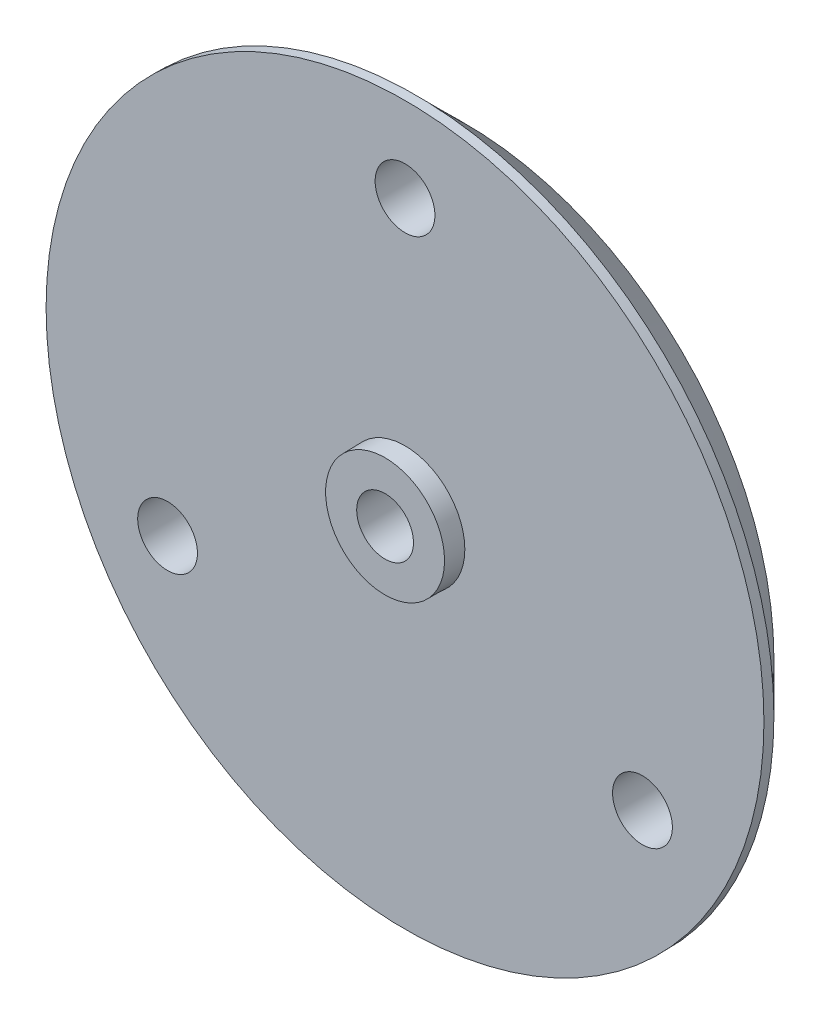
ISO-10303-21;
HEADER;
FILE_DESCRIPTION(('STEP AP214'),'2;1');
FILE_NAME('part.step','',(''),(''),'','','');
FILE_SCHEMA(('AUTOMOTIVE_DESIGN { 1 0 10303 214 1 1 1 1 }'));
ENDSEC;
DATA;
#1=APPLICATION_CONTEXT('core data for automotive mechanical design processes');
#2=APPLICATION_PROTOCOL_DEFINITION('international standard','automotive_design',2000,#1);
#3=PRODUCT_CONTEXT('',#1,'mechanical');
#4=PRODUCT('Part','Part','',(#3));
#5=PRODUCT_RELATED_PRODUCT_CATEGORY('part','',(#4));
#6=PRODUCT_DEFINITION_FORMATION('','',#4);
#7=PRODUCT_DEFINITION_CONTEXT('part definition',#1,'design');
#8=PRODUCT_DEFINITION('design','',#6,#7);
#9=PRODUCT_DEFINITION_SHAPE('','',#8);
#10=(LENGTH_UNIT() NAMED_UNIT(*) SI_UNIT(.MILLI.,.METRE.));
#11=(NAMED_UNIT(*) PLANE_ANGLE_UNIT() SI_UNIT($,.RADIAN.));
#12=(NAMED_UNIT(*) SI_UNIT($,.STERADIAN.) SOLID_ANGLE_UNIT());
#13=UNCERTAINTY_MEASURE_WITH_UNIT(LENGTH_MEASURE(1.E-05),#10,'distance_accuracy_value','');
#14=(GEOMETRIC_REPRESENTATION_CONTEXT(3) GLOBAL_UNCERTAINTY_ASSIGNED_CONTEXT((#13)) GLOBAL_UNIT_ASSIGNED_CONTEXT((#10,
#11,#12)) REPRESENTATION_CONTEXT('',''));
#15=CARTESIAN_POINT('',(0.,0.,0.));
#16=DIRECTION('',(0.,0.,1.));
#17=DIRECTION('',(1.,0.,0.));
#18=AXIS2_PLACEMENT_3D('',#15,#16,#17);
#19=CARTESIAN_POINT('',(29.85,29.85,0.));
#20=DIRECTION('',(0.,0.,1.));
#21=DIRECTION('',(1.,0.,0.));
#22=AXIS2_PLACEMENT_3D('',#19,#20,#21);
#23=PLANE('',#22);
#24=CARTESIAN_POINT('',(29.85,29.85,0.));
#25=DIRECTION('',(0.,0.,1.));
#26=DIRECTION('',(1.,0.,0.));
#27=AXIS2_PLACEMENT_3D('',#24,#25,#26);
#28=CIRCLE('',#27,17.99955);
#29=CARTESIAN_POINT('',(47.84955,29.85,0.));
#30=VERTEX_POINT('',#29);
#31=EDGE_CURVE('E37',#30,#30,#28,.T.);
#32=ORIENTED_EDGE('',*,*,#31,.T.);
#33=EDGE_LOOP('',(#32));
#34=FACE_BOUND('',#33,.T.);
#35=CARTESIAN_POINT('',(29.85,43.59965625,0.));
#36=DIRECTION('',(0.,0.,-1.));
#37=DIRECTION('',(-1.,0.,0.));
#38=AXIS2_PLACEMENT_3D('',#35,#36,#37);
#39=CIRCLE('',#38,1.4999625);
#40=CARTESIAN_POINT('',(28.3500375,43.59965625,0.));
#41=VERTEX_POINT('',#40);
#42=EDGE_CURVE('E134',#41,#41,#39,.T.);
#43=ORIENTED_EDGE('',*,*,#42,.T.);
#44=EDGE_LOOP('',(#43));
#45=FACE_BOUND('',#44,.T.);
#46=CARTESIAN_POINT('',(41.7575516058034,22.975171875,0.));
#47=DIRECTION('',(0.,0.,-1.));
#48=DIRECTION('',(0.5,0.866025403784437,0.));
#49=AXIS2_PLACEMENT_3D('',#46,#47,#48);
#50=CIRCLE('',#49,1.4999625);
#51=CARTESIAN_POINT('',(42.5075328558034,24.274177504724,0.));
#52=VERTEX_POINT('',#51);
#53=EDGE_CURVE('E126',#52,#52,#50,.T.);
#54=ORIENTED_EDGE('',*,*,#53,.T.);
#55=EDGE_LOOP('',(#54));
#56=FACE_BOUND('',#55,.T.);
#57=CARTESIAN_POINT('',(17.9424483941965,22.9751718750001,0.));
#58=DIRECTION('',(0.,0.,-1.));
#59=DIRECTION('',(0.499999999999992,-0.866025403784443,0.));
#60=AXIS2_PLACEMENT_3D('',#57,#58,#59);
#61=CIRCLE('',#60,1.4999625);
#62=CARTESIAN_POINT('',(18.6924296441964,21.6761662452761,0.));
#63=VERTEX_POINT('',#62);
#64=EDGE_CURVE('E97',#63,#63,#61,.T.);
#65=ORIENTED_EDGE('',*,*,#64,.T.);
#66=EDGE_LOOP('',(#65));
#67=FACE_BOUND('',#66,.T.);
#68=CARTESIAN_POINT('',(29.85,29.85,0.));
#69=DIRECTION('',(0.,0.,1.));
#70=DIRECTION('',(1.,0.,0.));
#71=AXIS2_PLACEMENT_3D('',#68,#69,#70);
#72=CIRCLE('',#71,2.999925);
#73=CARTESIAN_POINT('',(32.849925,29.85,0.));
#74=VERTEX_POINT('',#73);
#75=EDGE_CURVE('E84',#74,#74,#72,.T.);
#76=ORIENTED_EDGE('',*,*,#75,.F.);
#77=EDGE_LOOP('',(#76));
#78=FACE_BOUND('',#77,.T.);
#79=ADVANCED_FACE('F14',(#34,#45,#56,#67,#78),#23,.T.);
#80=CARTESIAN_POINT('',(29.85,29.85,-2.999925));
#81=DIRECTION('',(0.,0.,1.));
#82=DIRECTION('',(1.,0.,0.));
#83=AXIS2_PLACEMENT_3D('',#80,#81,#82);
#84=PLANE('',#83);
#85=CARTESIAN_POINT('',(29.85,29.85,-2.999925));
#86=DIRECTION('',(0.,0.,1.));
#87=DIRECTION('',(1.,0.,0.));
#88=AXIS2_PLACEMENT_3D('',#85,#86,#87);
#89=CIRCLE('',#88,8.97770365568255);
#90=CARTESIAN_POINT('',(38.8277036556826,29.85,-2.999925));
#91=VERTEX_POINT('',#90);
#92=EDGE_CURVE('E53',#91,#91,#89,.F.);
#93=ORIENTED_EDGE('',*,*,#92,.F.);
#94=EDGE_LOOP('',(#93));
#95=FACE_BOUND('',#94,.T.);
#96=CARTESIAN_POINT('',(29.85,29.85,-2.999925));
#97=DIRECTION('',(0.,0.,1.));
#98=DIRECTION('',(1.,0.,0.));
#99=AXIS2_PLACEMENT_3D('',#96,#97,#98);
#100=CIRCLE('',#99,10.9217988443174);
#101=CARTESIAN_POINT('',(40.7717988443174,29.85,-2.999925));
#102=VERTEX_POINT('',#101);
#103=EDGE_CURVE('E70',#102,#102,#100,.F.);
#104=ORIENTED_EDGE('',*,*,#103,.T.);
#105=EDGE_LOOP('',(#104));
#106=FACE_BOUND('',#105,.T.);
#107=ADVANCED_FACE('F203',(#95,#106),#84,.F.);
#108=CARTESIAN_POINT('',(29.85,29.85,-2.999925));
#109=DIRECTION('',(0.,0.,1.));
#110=DIRECTION('',(1.,0.,0.));
#111=AXIS2_PLACEMENT_3D('',#108,#109,#110);
#112=CIRCLE('',#111,6.97775365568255);
#113=CARTESIAN_POINT('',(36.8277536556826,29.85,-2.999925));
#114=VERTEX_POINT('',#113);
#115=EDGE_CURVE('E59',#114,#114,#112,.F.);
#116=ORIENTED_EDGE('',*,*,#115,.F.);
#117=EDGE_LOOP('',(#116));
#118=FACE_BOUND('',#117,.T.);
#119=CARTESIAN_POINT('',(29.85,29.85,-2.999925));
#120=DIRECTION('',(0.,0.,1.));
#121=DIRECTION('',(1.,0.,0.));
#122=AXIS2_PLACEMENT_3D('',#119,#120,#121);
#123=CIRCLE('',#122,7.92187384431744);
#124=CARTESIAN_POINT('',(37.7718738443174,29.85,-2.999925));
#125=VERTEX_POINT('',#124);
#126=EDGE_CURVE('E74',#125,#125,#123,.F.);
#127=ORIENTED_EDGE('',*,*,#126,.T.);
#128=EDGE_LOOP('',(#127));
#129=FACE_BOUND('',#128,.T.);
#130=ADVANCED_FACE('F209',(#118,#129),#84,.F.);
#131=CARTESIAN_POINT('',(29.85,29.85,-2.999925));
#132=DIRECTION('',(0.,0.,1.));
#133=DIRECTION('',(1.,0.,0.));
#134=AXIS2_PLACEMENT_3D('',#131,#132,#133);
#135=CIRCLE('',#134,4.97780365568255);
#136=CARTESIAN_POINT('',(34.8278036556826,29.85,-2.999925));
#137=VERTEX_POINT('',#136);
#138=EDGE_CURVE('E41',#137,#137,#135,.F.);
#139=ORIENTED_EDGE('',*,*,#138,.F.);
#140=EDGE_LOOP('',(#139));
#141=FACE_BOUND('',#140,.T.);
#142=CARTESIAN_POINT('',(29.85,29.85,-2.999925));
#143=DIRECTION('',(0.,0.,1.));
#144=DIRECTION('',(1.,0.,0.));
#145=AXIS2_PLACEMENT_3D('',#142,#143,#144);
#146=CIRCLE('',#145,5.92192384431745);
#147=CARTESIAN_POINT('',(35.7719238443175,29.85,-2.999925));
#148=VERTEX_POINT('',#147);
#149=EDGE_CURVE('E69',#148,#148,#146,.F.);
#150=ORIENTED_EDGE('',*,*,#149,.T.);
#151=EDGE_LOOP('',(#150));
#152=FACE_BOUND('',#151,.T.);
#153=ADVANCED_FACE('F217',(#141,#152),#84,.F.);
#154=CARTESIAN_POINT('',(29.85,29.85,-1.399965));
#155=DIRECTION('',(0.,0.,-1.));
#156=DIRECTION('',(-1.,0.,0.));
#157=AXIS2_PLACEMENT_3D('',#154,#155,#156);
#158=CONICAL_SURFACE('',#157,4.94987625,0.0174532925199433);
#159=CARTESIAN_POINT('',(29.85,29.85,-1.399965));
#160=DIRECTION('',(0.,0.,-1.));
#161=DIRECTION('',(-1.,0.,0.));
#162=AXIS2_PLACEMENT_3D('',#159,#160,#161);
#163=CIRCLE('',#162,4.94987625);
#164=CARTESIAN_POINT('',(24.90012375,29.85,-1.399965));
#165=VERTEX_POINT('',#164);
#166=EDGE_CURVE('E45',#165,#165,#163,.T.);
#167=ORIENTED_EDGE('',*,*,#166,.F.);
#168=EDGE_LOOP('',(#167));
#169=FACE_BOUND('',#168,.T.);
#170=ORIENTED_EDGE('',*,*,#138,.T.);
#171=EDGE_LOOP('',(#170));
#172=FACE_BOUND('',#171,.T.);
#173=ADVANCED_FACE('F213',(#169,#172),#158,.F.);
#174=CARTESIAN_POINT('',(29.85,29.85,-1.399965));
#175=DIRECTION('',(0.,0.,-1.));
#176=DIRECTION('',(-1.,0.,0.));
#177=AXIS2_PLACEMENT_3D('',#174,#175,#176);
#178=PLANE('',#177);
#179=CARTESIAN_POINT('',(29.85,29.85,-1.399965));
#180=DIRECTION('',(0.,0.,-1.));
#181=DIRECTION('',(-1.,0.,0.));
#182=AXIS2_PLACEMENT_3D('',#179,#180,#181);
#183=CIRCLE('',#182,3.94990125);
#184=CARTESIAN_POINT('',(25.90009875,29.85,-1.399965));
#185=VERTEX_POINT('',#184);
#186=EDGE_CURVE('E46',#185,#185,#183,.T.);
#187=ORIENTED_EDGE('',*,*,#186,.F.);
#188=EDGE_LOOP('',(#187));
#189=FACE_BOUND('',#188,.T.);
#190=ORIENTED_EDGE('',*,*,#166,.T.);
#191=EDGE_LOOP('',(#190));
#192=FACE_BOUND('',#191,.T.);
#193=ADVANCED_FACE('F216',(#189,#192),#178,.T.);
#194=CARTESIAN_POINT('',(29.85,29.85,-1.399965));
#195=DIRECTION('',(0.,0.,1.));
#196=DIRECTION('',(-1.,0.,0.));
#197=AXIS2_PLACEMENT_3D('',#194,#195,#196);
#198=CONICAL_SURFACE('',#197,3.94990125,0.0174532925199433);
#199=ORIENTED_EDGE('',*,*,#186,.T.);
#200=EDGE_LOOP('',(#199));
#201=FACE_BOUND('',#200,.T.);
#202=CARTESIAN_POINT('',(29.85,29.85,-2.999925));
#203=DIRECTION('',(0.,0.,1.));
#204=DIRECTION('',(1.,0.,0.));
#205=AXIS2_PLACEMENT_3D('',#202,#203,#204);
#206=CIRCLE('',#205,3.92197384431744);
#207=CARTESIAN_POINT('',(33.7719738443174,29.85,-2.999925));
#208=VERTEX_POINT('',#207);
#209=EDGE_CURVE('E65',#208,#208,#206,.F.);
#210=ORIENTED_EDGE('',*,*,#209,.F.);
#211=EDGE_LOOP('',(#210));
#212=FACE_BOUND('',#211,.T.);
#213=ADVANCED_FACE('F236',(#201,#212),#198,.T.);
#214=CARTESIAN_POINT('',(29.85,29.85,-2.999925));
#215=DIRECTION('',(0.,0.,-1.));
#216=DIRECTION('',(-1.,0.,0.));
#217=AXIS2_PLACEMENT_3D('',#214,#215,#216);
#218=CIRCLE('',#217,1.424964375);
#219=CARTESIAN_POINT('',(28.425035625,29.85,-2.999925));
#220=VERTEX_POINT('',#219);
#221=EDGE_CURVE('E115',#220,#220,#218,.T.);
#222=ORIENTED_EDGE('',*,*,#221,.F.);
#223=EDGE_LOOP('',(#222));
#224=FACE_BOUND('',#223,.T.);
#225=ORIENTED_EDGE('',*,*,#209,.T.);
#226=EDGE_LOOP('',(#225));
#227=FACE_BOUND('',#226,.T.);
#228=ADVANCED_FACE('F223',(#224,#227),#84,.F.);
#229=CARTESIAN_POINT('',(29.85,29.85,-1.399965));
#230=DIRECTION('',(0.,0.,-1.));
#231=DIRECTION('',(-1.,0.,0.));
#232=AXIS2_PLACEMENT_3D('',#229,#230,#231);
#233=CONICAL_SURFACE('',#232,6.94982625,0.0174532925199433);
#234=CARTESIAN_POINT('',(29.85,29.85,-1.399965));
#235=DIRECTION('',(0.,0.,-1.));
#236=DIRECTION('',(-1.,0.,0.));
#237=AXIS2_PLACEMENT_3D('',#234,#235,#236);
#238=CIRCLE('',#237,6.94982625);
#239=CARTESIAN_POINT('',(22.90017375,29.85,-1.399965));
#240=VERTEX_POINT('',#239);
#241=EDGE_CURVE('E64',#240,#240,#238,.T.);
#242=ORIENTED_EDGE('',*,*,#241,.F.);
#243=EDGE_LOOP('',(#242));
#244=FACE_BOUND('',#243,.T.);
#245=ORIENTED_EDGE('',*,*,#115,.T.);
#246=EDGE_LOOP('',(#245));
#247=FACE_BOUND('',#246,.T.);
#248=ADVANCED_FACE('F219',(#244,#247),#233,.F.);
#249=CARTESIAN_POINT('',(29.85,29.85,-1.399965));
#250=DIRECTION('',(0.,0.,-1.));
#251=DIRECTION('',(-1.,0.,0.));
#252=AXIS2_PLACEMENT_3D('',#249,#250,#251);
#253=PLANE('',#252);
#254=CARTESIAN_POINT('',(29.85,29.85,-1.399965));
#255=DIRECTION('',(0.,0.,-1.));
#256=DIRECTION('',(-1.,0.,0.));
#257=AXIS2_PLACEMENT_3D('',#254,#255,#256);
#258=CIRCLE('',#257,5.94985125);
#259=CARTESIAN_POINT('',(23.90014875,29.85,-1.399965));
#260=VERTEX_POINT('',#259);
#261=EDGE_CURVE('E63',#260,#260,#258,.T.);
#262=ORIENTED_EDGE('',*,*,#261,.F.);
#263=EDGE_LOOP('',(#262));
#264=FACE_BOUND('',#263,.T.);
#265=ORIENTED_EDGE('',*,*,#241,.T.);
#266=EDGE_LOOP('',(#265));
#267=FACE_BOUND('',#266,.T.);
#268=ADVANCED_FACE('F222',(#264,#267),#253,.T.);
#269=CARTESIAN_POINT('',(29.85,29.85,-1.399965));
#270=DIRECTION('',(0.,0.,1.));
#271=DIRECTION('',(-1.,0.,0.));
#272=AXIS2_PLACEMENT_3D('',#269,#270,#271);
#273=CONICAL_SURFACE('',#272,5.94985125,0.0174532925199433);
#274=ORIENTED_EDGE('',*,*,#261,.T.);
#275=EDGE_LOOP('',(#274));
#276=FACE_BOUND('',#275,.T.);
#277=ORIENTED_EDGE('',*,*,#149,.F.);
#278=EDGE_LOOP('',(#277));
#279=FACE_BOUND('',#278,.T.);
#280=ADVANCED_FACE('F229',(#276,#279),#273,.T.);
#281=CARTESIAN_POINT('',(29.85,29.85,-1.399965));
#282=DIRECTION('',(0.,0.,-1.));
#283=DIRECTION('',(-1.,0.,0.));
#284=AXIS2_PLACEMENT_3D('',#281,#282,#283);
#285=CONICAL_SURFACE('',#284,8.94977625,0.0174532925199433);
#286=CARTESIAN_POINT('',(29.85,29.85,-1.399965));
#287=DIRECTION('',(0.,0.,-1.));
#288=DIRECTION('',(-1.,0.,0.));
#289=AXIS2_PLACEMENT_3D('',#286,#287,#288);
#290=CIRCLE('',#289,8.94977625);
#291=CARTESIAN_POINT('',(20.90022375,29.85,-1.399965));
#292=VERTEX_POINT('',#291);
#293=EDGE_CURVE('E58',#292,#292,#290,.T.);
#294=ORIENTED_EDGE('',*,*,#293,.F.);
#295=EDGE_LOOP('',(#294));
#296=FACE_BOUND('',#295,.T.);
#297=ORIENTED_EDGE('',*,*,#92,.T.);
#298=EDGE_LOOP('',(#297));
#299=FACE_BOUND('',#298,.T.);
#300=ADVANCED_FACE('F225',(#296,#299),#285,.F.);
#301=CARTESIAN_POINT('',(29.85,29.85,-1.399965));
#302=DIRECTION('',(0.,0.,-1.));
#303=DIRECTION('',(-1.,0.,0.));
#304=AXIS2_PLACEMENT_3D('',#301,#302,#303);
#305=PLANE('',#304);
#306=CARTESIAN_POINT('',(29.85,29.85,-1.399965));
#307=DIRECTION('',(0.,0.,-1.));
#308=DIRECTION('',(-1.,0.,0.));
#309=AXIS2_PLACEMENT_3D('',#306,#307,#308);
#310=CIRCLE('',#309,7.94980125);
#311=CARTESIAN_POINT('',(21.90019875,29.85,-1.399965));
#312=VERTEX_POINT('',#311);
#313=EDGE_CURVE('E57',#312,#312,#310,.T.);
#314=ORIENTED_EDGE('',*,*,#313,.F.);
#315=EDGE_LOOP('',(#314));
#316=FACE_BOUND('',#315,.T.);
#317=ORIENTED_EDGE('',*,*,#293,.T.);
#318=EDGE_LOOP('',(#317));
#319=FACE_BOUND('',#318,.T.);
#320=ADVANCED_FACE('F228',(#316,#319),#305,.T.);
#321=CARTESIAN_POINT('',(29.85,29.85,-1.399965));
#322=DIRECTION('',(0.,0.,1.));
#323=DIRECTION('',(-1.,0.,0.));
#324=AXIS2_PLACEMENT_3D('',#321,#322,#323);
#325=CONICAL_SURFACE('',#324,7.94980125,0.0174532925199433);
#326=ORIENTED_EDGE('',*,*,#313,.T.);
#327=EDGE_LOOP('',(#326));
#328=FACE_BOUND('',#327,.T.);
#329=ORIENTED_EDGE('',*,*,#126,.F.);
#330=EDGE_LOOP('',(#329));
#331=FACE_BOUND('',#330,.T.);
#332=ADVANCED_FACE('F234',(#328,#331),#325,.T.);
#333=CARTESIAN_POINT('',(29.85,29.85,-1.399965));
#334=DIRECTION('',(0.,0.,-1.));
#335=DIRECTION('',(-1.,0.,0.));
#336=AXIS2_PLACEMENT_3D('',#333,#334,#335);
#337=CONICAL_SURFACE('',#336,11.94970125,0.0174532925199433);
#338=CARTESIAN_POINT('',(29.85,29.85,-1.399965));
#339=DIRECTION('',(0.,0.,-1.));
#340=DIRECTION('',(-1.,0.,0.));
#341=AXIS2_PLACEMENT_3D('',#338,#339,#340);
#342=CIRCLE('',#341,11.94970125);
#343=CARTESIAN_POINT('',(17.90029875,29.85,-1.399965));
#344=VERTEX_POINT('',#343);
#345=EDGE_CURVE('E52',#344,#344,#342,.T.);
#346=ORIENTED_EDGE('',*,*,#345,.F.);
#347=EDGE_LOOP('',(#346));
#348=FACE_BOUND('',#347,.T.);
#349=CARTESIAN_POINT('',(29.85,29.85,-2.999925));
#350=DIRECTION('',(0.,0.,1.));
#351=DIRECTION('',(1.,0.,0.));
#352=AXIS2_PLACEMENT_3D('',#349,#350,#351);
#353=CIRCLE('',#352,11.9776286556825);
#354=CARTESIAN_POINT('',(41.8276286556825,29.85,-2.999925));
#355=VERTEX_POINT('',#354);
#356=EDGE_CURVE('E47',#355,#355,#353,.F.);
#357=ORIENTED_EDGE('',*,*,#356,.T.);
#358=EDGE_LOOP('',(#357));
#359=FACE_BOUND('',#358,.T.);
#360=ADVANCED_FACE('F231',(#348,#359),#337,.F.);
#361=CARTESIAN_POINT('',(29.85,29.85,-1.399965));
#362=DIRECTION('',(0.,0.,-1.));
#363=DIRECTION('',(-1.,0.,0.));
#364=AXIS2_PLACEMENT_3D('',#361,#362,#363);
#365=PLANE('',#364);
#366=CARTESIAN_POINT('',(29.85,29.85,-1.399965));
#367=DIRECTION('',(0.,0.,-1.));
#368=DIRECTION('',(-1.,0.,0.));
#369=AXIS2_PLACEMENT_3D('',#366,#367,#368);
#370=CIRCLE('',#369,10.94972625);
#371=CARTESIAN_POINT('',(18.90027375,29.85,-1.399965));
#372=VERTEX_POINT('',#371);
#373=EDGE_CURVE('E51',#372,#372,#370,.T.);
#374=ORIENTED_EDGE('',*,*,#373,.F.);
#375=EDGE_LOOP('',(#374));
#376=FACE_BOUND('',#375,.T.);
#377=ORIENTED_EDGE('',*,*,#345,.T.);
#378=EDGE_LOOP('',(#377));
#379=FACE_BOUND('',#378,.T.);
#380=ADVANCED_FACE('F199',(#376,#379),#365,.T.);
#381=CARTESIAN_POINT('',(29.85,29.85,-1.399965));
#382=DIRECTION('',(0.,0.,1.));
#383=DIRECTION('',(-1.,0.,0.));
#384=AXIS2_PLACEMENT_3D('',#381,#382,#383);
#385=CONICAL_SURFACE('',#384,10.94972625,0.0174532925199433);
#386=ORIENTED_EDGE('',*,*,#373,.T.);
#387=EDGE_LOOP('',(#386));
#388=FACE_BOUND('',#387,.T.);
#389=ORIENTED_EDGE('',*,*,#103,.F.);
#390=EDGE_LOOP('',(#389));
#391=FACE_BOUND('',#390,.T.);
#392=ADVANCED_FACE('F188',(#388,#391),#385,.T.);
#393=CARTESIAN_POINT('',(29.85,29.85,0.));
#394=DIRECTION('',(0.,0.,1.));
#395=DIRECTION('',(-1.,0.,0.));
#396=AXIS2_PLACEMENT_3D('',#393,#394,#395);
#397=CONICAL_SURFACE('',#396,17.99955,0.0174532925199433);
#398=CARTESIAN_POINT('',(29.85,29.85,-0.508869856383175));
#399=DIRECTION('',(0.,0.,-1.));
#400=DIRECTION('',(-1.,0.,0.));
#401=AXIS2_PLACEMENT_3D('',#398,#399,#400);
#402=CIRCLE('',#401,17.9906676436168);
#403=CARTESIAN_POINT('',(11.8593323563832,29.85,-0.508869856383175));
#404=VERTEX_POINT('',#403);
#405=EDGE_CURVE('E18',#404,#404,#402,.F.);
#406=ORIENTED_EDGE('',*,*,#405,.T.);
#407=EDGE_LOOP('',(#406));
#408=FACE_BOUND('',#407,.T.);
#409=ORIENTED_EDGE('',*,*,#31,.F.);
#410=EDGE_LOOP('',(#409));
#411=FACE_BOUND('',#410,.T.);
#412=ADVANCED_FACE('F16',(#408,#411),#397,.T.);
#413=CARTESIAN_POINT('',(29.85,29.85,-0.499987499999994));
#414=DIRECTION('',(0.,0.,1.));
#415=DIRECTION('',(1.,0.,0.));
#416=AXIS2_PLACEMENT_3D('',#413,#414,#415);
#417=CONICAL_SURFACE('',#416,17.99955,0.78539816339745);
#418=CARTESIAN_POINT('',(29.85,29.85,-2.999925));
#419=DIRECTION('',(0.,0.,1.));
#420=DIRECTION('',(1.,0.,0.));
#421=AXIS2_PLACEMENT_3D('',#418,#419,#420);
#422=CIRCLE('',#421,15.4996125);
#423=CARTESIAN_POINT('',(45.3496125,29.85,-2.999925));
#424=VERTEX_POINT('',#423);
#425=EDGE_CURVE('E10',#424,#424,#422,.F.);
#426=ORIENTED_EDGE('',*,*,#425,.F.);
#427=EDGE_LOOP('',(#426));
#428=FACE_BOUND('',#427,.T.);
#429=ORIENTED_EDGE('',*,*,#405,.F.);
#430=EDGE_LOOP('',(#429));
#431=FACE_BOUND('',#430,.T.);
#432=ADVANCED_FACE('F187',(#428,#431),#417,.T.);
#433=CARTESIAN_POINT('',(17.9424483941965,22.9751718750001,-2.999925));
#434=DIRECTION('',(0.,0.,-1.));
#435=DIRECTION('',(0.499999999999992,-0.866025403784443,0.));
#436=AXIS2_PLACEMENT_3D('',#433,#434,#435);
#437=CIRCLE('',#436,1.4999625);
#438=CARTESIAN_POINT('',(18.6924296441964,21.6761662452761,-2.999925));
#439=VERTEX_POINT('',#438);
#440=EDGE_CURVE('E83',#439,#439,#437,.T.);
#441=ORIENTED_EDGE('',*,*,#440,.F.);
#442=EDGE_LOOP('',(#441));
#443=FACE_BOUND('',#442,.T.);
#444=CARTESIAN_POINT('',(41.7575516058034,22.975171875,-2.999925));
#445=DIRECTION('',(0.,0.,-1.));
#446=DIRECTION('',(0.5,0.866025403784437,0.));
#447=AXIS2_PLACEMENT_3D('',#444,#445,#446);
#448=CIRCLE('',#447,1.4999625);
#449=CARTESIAN_POINT('',(42.5075328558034,24.274177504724,-2.999925));
#450=VERTEX_POINT('',#449);
#451=EDGE_CURVE('E122',#450,#450,#448,.T.);
#452=ORIENTED_EDGE('',*,*,#451,.F.);
#453=EDGE_LOOP('',(#452));
#454=FACE_BOUND('',#453,.T.);
#455=CARTESIAN_POINT('',(29.85,43.59965625,-2.999925));
#456=DIRECTION('',(0.,0.,-1.));
#457=DIRECTION('',(-1.,0.,0.));
#458=AXIS2_PLACEMENT_3D('',#455,#456,#457);
#459=CIRCLE('',#458,1.4999625);
#460=CARTESIAN_POINT('',(28.3500375,43.59965625,-2.999925));
#461=VERTEX_POINT('',#460);
#462=EDGE_CURVE('E130',#461,#461,#459,.T.);
#463=ORIENTED_EDGE('',*,*,#462,.F.);
#464=EDGE_LOOP('',(#463));
#465=FACE_BOUND('',#464,.T.);
#466=ORIENTED_EDGE('',*,*,#356,.F.);
#467=EDGE_LOOP('',(#466));
#468=FACE_BOUND('',#467,.T.);
#469=ORIENTED_EDGE('',*,*,#425,.T.);
#470=EDGE_LOOP('',(#469));
#471=FACE_BOUND('',#470,.T.);
#472=ADVANCED_FACE('F196',(#443,#454,#465,#468,#471),#84,.F.);
#473=CARTESIAN_POINT('',(29.85,43.59965625,0.));
#474=DIRECTION('',(0.,0.,-1.));
#475=DIRECTION('',(-1.,0.,0.));
#476=AXIS2_PLACEMENT_3D('',#473,#474,#475);
#477=CYLINDRICAL_SURFACE('',#476,1.4999625);
#478=ORIENTED_EDGE('',*,*,#42,.F.);
#479=EDGE_LOOP('',(#478));
#480=FACE_BOUND('',#479,.T.);
#481=ORIENTED_EDGE('',*,*,#462,.T.);
#482=EDGE_LOOP('',(#481));
#483=FACE_BOUND('',#482,.T.);
#484=ADVANCED_FACE('F265',(#480,#483),#477,.F.);
#485=CARTESIAN_POINT('',(41.7575516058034,22.975171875,0.));
#486=DIRECTION('',(0.,0.,-1.));
#487=DIRECTION('',(-1.,0.,0.));
#488=AXIS2_PLACEMENT_3D('',#485,#486,#487);
#489=CYLINDRICAL_SURFACE('',#488,1.4999625);
#490=ORIENTED_EDGE('',*,*,#53,.F.);
#491=EDGE_LOOP('',(#490));
#492=FACE_BOUND('',#491,.T.);
#493=ORIENTED_EDGE('',*,*,#451,.T.);
#494=EDGE_LOOP('',(#493));
#495=FACE_BOUND('',#494,.T.);
#496=ADVANCED_FACE('F258',(#492,#495),#489,.F.);
#497=CARTESIAN_POINT('',(17.9424483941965,22.9751718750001,0.));
#498=DIRECTION('',(0.,0.,-1.));
#499=DIRECTION('',(-1.,0.,0.));
#500=AXIS2_PLACEMENT_3D('',#497,#498,#499);
#501=CYLINDRICAL_SURFACE('',#500,1.4999625);
#502=ORIENTED_EDGE('',*,*,#64,.F.);
#503=EDGE_LOOP('',(#502));
#504=FACE_BOUND('',#503,.T.);
#505=ORIENTED_EDGE('',*,*,#440,.T.);
#506=EDGE_LOOP('',(#505));
#507=FACE_BOUND('',#506,.T.);
#508=ADVANCED_FACE('F248',(#504,#507),#501,.F.);
#509=CARTESIAN_POINT('',(29.85,29.85,0.));
#510=DIRECTION('',(0.,0.,-1.));
#511=DIRECTION('',(1.,0.,0.));
#512=AXIS2_PLACEMENT_3D('',#509,#510,#511);
#513=CONICAL_SURFACE('',#512,2.999925,0.0174532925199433);
#514=CARTESIAN_POINT('',(29.85,29.85,0.999975));
#515=DIRECTION('',(0.,0.,1.));
#516=DIRECTION('',(1.,0.,0.));
#517=AXIS2_PLACEMENT_3D('',#514,#515,#516);
#518=CIRCLE('',#517,2.98247037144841);
#519=CARTESIAN_POINT('',(32.8324703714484,29.85,0.999975));
#520=VERTEX_POINT('',#519);
#521=EDGE_CURVE('E80',#520,#520,#518,.T.);
#522=ORIENTED_EDGE('',*,*,#521,.F.);
#523=EDGE_LOOP('',(#522));
#524=FACE_BOUND('',#523,.T.);
#525=ORIENTED_EDGE('',*,*,#75,.T.);
#526=EDGE_LOOP('',(#525));
#527=FACE_BOUND('',#526,.T.);
#528=ADVANCED_FACE('F245',(#524,#527),#513,.T.);
#529=CARTESIAN_POINT('',(29.85,29.85,0.999975));
#530=DIRECTION('',(0.,0.,1.));
#531=DIRECTION('',(1.,0.,0.));
#532=AXIS2_PLACEMENT_3D('',#529,#530,#531);
#533=PLANE('',#532);
#534=CARTESIAN_POINT('',(29.85,29.85,0.999975));
#535=DIRECTION('',(0.,0.,-1.));
#536=DIRECTION('',(-1.,0.,0.));
#537=AXIS2_PLACEMENT_3D('',#534,#535,#536);
#538=CIRCLE('',#537,1.424964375);
#539=CARTESIAN_POINT('',(28.425035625,29.85,0.999975));
#540=VERTEX_POINT('',#539);
#541=EDGE_CURVE('E101',#540,#540,#538,.T.);
#542=ORIENTED_EDGE('',*,*,#541,.T.);
#543=EDGE_LOOP('',(#542));
#544=FACE_BOUND('',#543,.T.);
#545=ORIENTED_EDGE('',*,*,#521,.T.);
#546=EDGE_LOOP('',(#545));
#547=FACE_BOUND('',#546,.T.);
#548=ADVANCED_FACE('F247',(#544,#547),#533,.T.);
#549=CARTESIAN_POINT('',(29.85,29.85,0.999975));
#550=DIRECTION('',(0.,0.,-1.));
#551=DIRECTION('',(-1.,0.,0.));
#552=AXIS2_PLACEMENT_3D('',#549,#550,#551);
#553=CYLINDRICAL_SURFACE('',#552,1.424964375);
#554=ORIENTED_EDGE('',*,*,#541,.F.);
#555=EDGE_LOOP('',(#554));
#556=FACE_BOUND('',#555,.T.);
#557=ORIENTED_EDGE('',*,*,#221,.T.);
#558=EDGE_LOOP('',(#557));
#559=FACE_BOUND('',#558,.T.);
#560=ADVANCED_FACE('F255',(#556,#559),#553,.F.);
#561=CLOSED_SHELL('',(#79,#107,#130,#153,#173,#193,#213,#228,#248,#268,#280,#300,#320,#332,#360,
#380,#392,#412,#432,#472,#484,#496,#508,#528,#548,#560));
#562=MANIFOLD_SOLID_BREP('B1',#561);
#563=ADVANCED_BREP_SHAPE_REPRESENTATION('',(#18,#562),#14);
#564=SHAPE_DEFINITION_REPRESENTATION(#9,#563);
ENDSEC;
END-ISO-10303-21;
